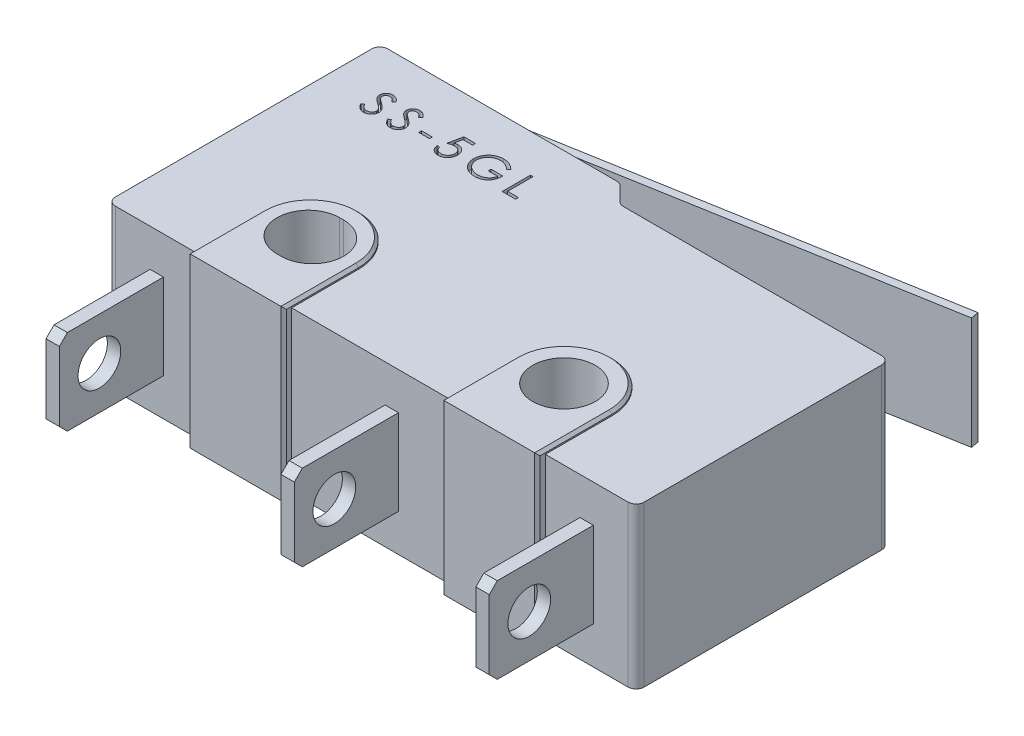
from build123d import *

# Parameters (mm, degrees)
BASE_EXTRUDE_DEPTH       = 6
SKETCH2_R                = 1.175
CUT_EXTRUDE1_DEPTH       = 24.066859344
BOSS_EXTRUDE1_START      = 0.15
SKETCH3_R                = 1.175
BOSS_EXTRUDE1_DEPTH      = 0.15
SKETCH4_R                = 1.175
BOSS_EXTRUDE2_DEPTH      = 0.15
CHAMFER1_SIZE            = 0.1
SKETCH5_W                = 2
SKETCH5_H                = 3.2
BOSS_EXTRUDE3_DEPTH      = 1.2
FILLET1_R                = 0.7
SKETCH6_W                = 0.5
SKETCH6_H                = 3.2
BOSS_EXTRUDE4_DEPTH      = 3.9
CHAMFER2_SIZE            = 0.3
SKETCH7_R                = 0.8
CUT_EXTRUDE2_DEPTH       = 23.338811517
BOSS_EXTRUDE5_DEPTH      = 0.3
CHAMFER3_SIZE            = 0.1
BOSS_EXTRUDE6_DEPTH      = 2.1
BOSS_EXTRUDE6_DEPTH_BACK = 2.1
SKETCH12_W               = 0.407051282
SKETCH12_H               = 0.108547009
CUT_EXTRUDE3_DEPTH       = 0.3


with BuildPart() as part:
    # Sketch1 → Base-Extrude (new body)
    with BuildSketch(Plane(origin=(0, 0, 0), x_dir=(1, 0, 0), z_dir=(0, 1, 0))):
        with BuildLine():
            Line((19.5, 9.5), (9.824264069, 9.5))
            ThreePointArc((9.824264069, 9.5), (9.709459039, 9.52283614), (9.612132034, 9.587867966))
            Line((9.612132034, 9.587867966), (9.087867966, 10.112132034))
            ThreePointArc((9.087867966, 10.112132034), (8.990540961, 10.17716386), (8.875735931, 10.2))
            Line((8.875735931, 10.2), (0.3, 10.2))
            ThreePointArc((0.3, 10.2), (0.087867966, 10.112132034), (0, 9.9))
            Line((0, 9.9), (0, 0.3))
            ThreePointArc((0, 0.3), (0.087867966, 0.087867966), (0.3, 0))
            Line((0.3, 0), (19.5, 0))
            ThreePointArc((19.5, 0), (19.712132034, 0.087867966), (19.8, 0.3))
            Line((19.8, 0.3), (19.8, 9.2))
            ThreePointArc((19.8, 9.2), (19.712132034, 9.412132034), (19.5, 9.5))
        make_face()
    extrude(amount=BASE_EXTRUDE_DEPTH)

    # Sketch2 → Cut-Extrude1 (cut, through all)
    with BuildSketch(Plane(origin=(0, 6, 0), x_dir=(-1, 0, 0), z_dir=(0, 1, 0))):
        with Locations(Location((-14.6, -2.5, 0), (0, 0, 90))):
            Circle(SKETCH2_R)
        with BuildLine():
            Line((-5.025, -3.675), (-5.175, -3.675))
            ThreePointArc((-5.175, -3.675), (-6.35, -2.5), (-5.175, -1.325))
            Line((-5.175, -1.325), (-5.025, -1.325))
            ThreePointArc((-5.025, -1.325), (-3.85, -2.5), (-5.025, -3.675))
        make_face()
    extrude(amount=-CUT_EXTRUDE1_DEPTH, mode=Mode.SUBTRACT)

    # Sketch3 → Boss-Extrude1 (add)
    # profile 1 of 2: a face of its own
    with BuildSketch(Plane(origin=(0, 6, 0), x_dir=(-1, 0, 0), z_dir=(0, 1, 0)).offset(BOSS_EXTRUDE1_START)):
        with BuildLine():
            Line((-3.3, 0), (-6.9, 0))
            Line((-6.9, 0), (-6.9, -2.5))
            ThreePointArc((-6.9, -2.5), (-5.1, -4.3), (-3.3, -2.5))
            Line((-3.3, -2.5), (-3.3, 0))
        make_face()
        with BuildLine():
            Line((-5.175, -3.675), (-5.025, -3.675))
            ThreePointArc((-5.025, -3.675), (-3.85, -2.5), (-5.025, -1.325))
            Line((-5.025, -1.325), (-5.175, -1.325))
            ThreePointArc((-5.175, -1.325), (-6.35, -2.5), (-5.175, -3.675))
        make_face(mode=Mode.SUBTRACT)
    # profile 2 of 2: a face of its own
    with BuildSketch(Plane(origin=(0, 6, 0), x_dir=(-1, 0, 0), z_dir=(0, 1, 0)).offset(BOSS_EXTRUDE1_START)):
        with BuildLine():
            Line((-12.8, -2.5), (-12.8, 0))
            Line((-12.8, 0), (-16.4, 0))
            Line((-16.4, 0), (-16.4, -2.5))
            ThreePointArc((-16.4, -2.5), (-14.6, -4.3), (-12.8, -2.5))
        make_face()
        with Locations(Location((-14.6, -2.5, 0), (0, 0, 90))):
            Circle(SKETCH3_R, mode=Mode.SUBTRACT)
    extrude(amount=-BOSS_EXTRUDE1_DEPTH)

    # Sketch4 → Boss-Extrude2 (add)
    # profile 1 of 2: a face of its own
    with BuildSketch(Plane.XZ):
        with BuildLine():
            Line((16.4, 0), (12.8, 0))
            Line((12.8, 0), (12.8, -2.5))
            ThreePointArc((12.8, -2.5), (14.6, -4.3), (16.4, -2.5))
            Line((16.4, -2.5), (16.4, 0))
        make_face()
        with Locations(Location((14.6, -2.5, 0), (0, 0, 90))):
            Circle(SKETCH4_R, mode=Mode.SUBTRACT)
    # profile 2 of 2: a face of its own
    with BuildSketch(Plane.XZ):
        with BuildLine():
            Line((3.3, 0), (3.3, -2.5))
            ThreePointArc((3.3, -2.5), (5.1, -4.3), (6.9, -2.5))
            Line((6.9, -2.5), (6.9, 0))
            Line((6.9, 0), (3.3, 0))
        make_face()
        with BuildLine():
            Line((5.025, -1.325), (5.175, -1.325))
            ThreePointArc((5.175, -1.325), (6.35, -2.5), (5.175, -3.675))
            Line((5.175, -3.675), (5.025, -3.675))
            ThreePointArc((5.025, -3.675), (3.85, -2.5), (5.025, -1.325))
        make_face(mode=Mode.SUBTRACT)
    extrude(amount=BOSS_EXTRUDE2_DEPTH)

    # Chamfer1
    chamfer1_edges = [part.edges().sort_by_distance(p)[0] for p in [
        (5.1, -0.15, -4.3),
        (6.9, -0.15, -1.25),
        (3.3, -0.15, -1.25),
        (3.3, 6.15, -1.25),
        (6.9, 6.15, -1.25),
        (5.1, 6.15, -4.3),
        (16.4, 6.15, -1.25),
        (14.6, 6.15, -4.3),
        (12.8, 6.15, -1.25),
        (12.8, -0.15, -1.25),
        (14.6, -0.15, -4.3),
        (16.4, -0.15, -1.25),
    ]]
    chamfer(chamfer1_edges, length=CHAMFER1_SIZE)

    # Sketch5 → Boss-Extrude3 (add)
    with BuildSketch(Plane(origin=(0, 0, -10.2), x_dir=(-1, 0, 0), z_dir=(0, 0, -1))):
        with Locations((-7.1, 3)):
            Rectangle(SKETCH5_W, SKETCH5_H)
    extrude(amount=BOSS_EXTRUDE3_DEPTH)

    # Fillet1
    fillet1_edges = [part.edges().sort_by_distance(p)[0] for p in [
        (8.1, 3, -11.4),
        (6.1, 3, -11.4),
    ]]
    fillet(fillet1_edges, radius=FILLET1_R)

    # Sketch6 → Boss-Extrude4 (add)
    with BuildSketch(Plane.XY):
        with Locations((1.85, 3)):
            Rectangle(SKETCH6_W, SKETCH6_H)
        with Locations((10.65, 3)):
            Rectangle(SKETCH6_W, SKETCH6_H)
        with Locations((17.95, 3)):
            Rectangle(SKETCH6_W, SKETCH6_H)
    extrude(amount=BOSS_EXTRUDE4_DEPTH)

    # Chamfer2
    chamfer2_edges = [part.edges().sort_by_distance(p)[0] for p in [
        (1.85, 1.4, 3.9),
        (1.85, 4.6, 3.9),
        (10.65, 1.4, 3.9),
        (10.65, 4.6, 3.9),
        (17.95, 1.4, 3.9),
        (17.95, 4.6, 3.9),
    ]]
    chamfer(chamfer2_edges, length=CHAMFER2_SIZE)

    # Sketch7 → Cut-Extrude2 (cut, through all)
    with BuildSketch(Plane.ZY.offset(-1.6)):
        with Locations((2.4, 3)):
            Circle(SKETCH7_R)
    extrude(amount=-CUT_EXTRUDE2_DEPTH, mode=Mode.SUBTRACT)

    # Sketch8 → Boss-Extrude5 (add)
    with BuildSketch(Plane.XY):
        Polygon((16.4, -0.05), (16.4, 6.05), (16.3, 6.15), (12.9, 6.15), (12.8, 6.05), (12.8, -0.05), (12.9, -0.15), (16.3, -0.15), align=None)
        Polygon((6.9, -0.05), (6.9, 6.05), (6.8, 6.15), (3.4, 6.15), (3.3, 6.05), (3.3, -0.05), (3.4, -0.15), (6.8, -0.15), align=None)
    extrude(amount=BOSS_EXTRUDE5_DEPTH)

    # Chamfer3
    chamfer3_edges = [part.edges().sort_by_distance(p)[0] for p in [
        (12.8, 3, 0.3),
        (16.4, 3, 0.3),
        (3.3, 3, 0.3),
        (6.9, 3, 0.3),
    ]]
    chamfer(chamfer3_edges, length=CHAMFER3_SIZE)

    # Sketch11 → Boss-Extrude6 (add, two sides: drawn at the far end of the back side and taken through both)
    with BuildSketch(Plane(origin=(0, 3, 0), x_dir=(-1, 0, 0), z_dir=(0, 1, 0)).offset(-BOSS_EXTRUDE6_DEPTH_BACK)):
        with BuildLine():
            Line((-19.005311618, -13.6), (-2.948383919, -10.795526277))
            ThreePointArc((-2.948383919, -10.795526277), (-2.770342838, -10.693022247), (-2.7, -10.5))
            Line((-2.7, -10.5), (-2.7, -10.2))
            Line((-2.7, -10.2), (-3, -10.2))
            Line((-3, -10.2), (-3, -10.5))
            Line((-3, -10.5), (-19.056927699, -13.304473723))
            Line((-19.056927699, -13.304473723), (-19.005311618, -13.6))
        make_face()
    extrude(amount=BOSS_EXTRUDE6_DEPTH + BOSS_EXTRUDE6_DEPTH_BACK)

    # Sketch12 → Cut-Extrude3 (cut)
    with BuildSketch(Plane(origin=(-12.497117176, 6, -3.291404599), x_dir=(1, 0, 0), z_dir=(0, 1, 0))):
        with BuildLine():
            Line((14.069489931, 4.629493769), (14.158956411, 4.683131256))
            add(Edge.make_bspline(
                [(14.158956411, 4.683131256), (14.167277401, 4.669202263), (14.183220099, 4.642514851), (14.209814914, 4.606453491), (14.237371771, 4.575803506), (14.266094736, 4.550743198), (14.295808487, 4.531013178), (14.326706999, 4.517042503), (14.358686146, 4.508329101), (14.380449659, 4.507270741), (14.391314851, 4.506742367)],
                knots=[0, 0, 0, 0, 1.272034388, 2.437168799, 3.508375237, 4.49857839, 5.41946034, 6.295179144, 7.148887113, 8, 8, 8, 8], degree=3))
            add(Edge.make_bspline(
                [(14.391314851, 4.506742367), (14.400593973, 4.507000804), (14.418989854, 4.507513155), (14.446071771, 4.512436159), (14.472373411, 4.519999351), (14.497352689, 4.530830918), (14.520664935, 4.543935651), (14.541107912, 4.559764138), (14.558780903, 4.577485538), (14.573237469, 4.597256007), (14.584328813, 4.618518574), (14.592853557, 4.640343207), (14.597584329, 4.66307275), (14.598296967, 4.67837639), (14.598656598, 4.686099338)],
                knots=[0, 0, 0, 0, 1.095163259, 2.171163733, 3.241058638, 4.321873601, 5.38011039, 6.391990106, 7.366004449, 8.327778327, 9.272591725, 10.192022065, 11.087607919, 12, 12, 12, 12], degree=3))
            add(Edge.make_bspline(
                [(14.598656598, 4.686099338), (14.598210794, 4.694910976), (14.597304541, 4.712823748), (14.589644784, 4.739251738), (14.577595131, 4.765405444), (14.566478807, 4.781583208), (14.560707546, 4.789982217)],
                knots=[0, 0, 0, 0, 0.938893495, 1.908633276, 2.914225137, 4, 4, 4, 4], degree=3))
            add(Edge.make_bspline(
                [(14.560707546, 4.789982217), (14.555969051, 4.796043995), (14.546021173, 4.808769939), (14.528919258, 4.827712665), (14.508851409, 4.847252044), (14.486504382, 4.868134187), (14.461064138, 4.889387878), (14.433327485, 4.912026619), (14.402586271, 4.935189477), (14.381026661, 4.950723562), (14.369902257, 4.958738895)],
                knots=[0, 0, 0, 0, 0.722233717, 1.516239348, 2.393582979, 3.351407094, 4.387010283, 5.505090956, 6.712668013, 8, 8, 8, 8], degree=3))
            add(Edge.make_bspline(
                [(14.369902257, 4.958738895), (14.358767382, 4.96666992), (14.337478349, 4.981833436), (14.307706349, 5.004337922), (14.281083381, 5.024913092), (14.257727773, 5.043752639), (14.2376498, 5.060859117), (14.220691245, 5.076068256), (14.20728411, 5.08979138), (14.199828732, 5.098693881), (14.196481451, 5.102690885)],
                knots=[0, 0, 0, 0, 1.452282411, 2.77665338, 3.964542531, 5.026858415, 5.96415736, 6.766646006, 7.446254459, 8, 8, 8, 8], degree=3))
            add(Edge.make_bspline(
                [(14.196481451, 5.102690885), (14.191802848, 5.108920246), (14.182601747, 5.12117112), (14.170456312, 5.140319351), (14.16013328, 5.159920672), (14.15204086, 5.180027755), (14.145226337, 5.200358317), (14.140642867, 5.221177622), (14.13777285, 5.242392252), (14.137478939, 5.256668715), (14.137331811, 5.26381535)],
                knots=[0, 0, 0, 0, 1.068054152, 2.10047183, 3.106115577, 4.101338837, 5.06977816, 6.043150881, 7.020423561, 8, 8, 8, 8], degree=3))
            add(Edge.make_bspline(
                [(14.137331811, 5.26381535), (14.137726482, 5.275012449), (14.138507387, 5.297167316), (14.145111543, 5.3295314), (14.155535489, 5.360430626), (14.170138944, 5.389559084), (14.188964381, 5.416158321), (14.210749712, 5.440534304), (14.236697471, 5.461026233), (14.26516743, 5.478930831), (14.296329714, 5.492944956), (14.328984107, 5.503516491), (14.363182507, 5.509506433), (14.386345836, 5.510366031), (14.398099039, 5.510802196)],
                knots=[0, 0, 0, 0, 1.005424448, 1.989358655, 2.955360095, 3.929531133, 4.905563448, 5.876582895, 6.856512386, 7.866279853, 8.892233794, 9.918561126, 10.94386622, 12, 12, 12, 12], degree=3))
            add(Edge.make_bspline(
                [(14.398099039, 5.510802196), (14.410570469, 5.510372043), (14.435372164, 5.509516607), (14.471854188, 5.502078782), (14.506978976, 5.489771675), (14.53523444, 5.475805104), (14.557348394, 5.461855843), (14.574213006, 5.449149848), (14.591302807, 5.434522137), (14.608755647, 5.417933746), (14.626275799, 5.399232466), (14.644123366, 5.378546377), (14.662340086, 5.356001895), (14.67405912, 5.339907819), (14.680066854, 5.331657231)],
                knots=[0, 0, 0, 0, 1.286793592, 2.559021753, 3.825965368, 5.121522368, 5.803751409, 6.523245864, 7.299691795, 8.125521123, 9.008227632, 9.944561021, 10.946284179, 12, 12, 12, 12], degree=3))
            Line((14.680066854, 5.331657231), (14.594204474, 5.266571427))
            add(Edge.make_bspline(
                [(14.594204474, 5.266571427), (14.589019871, 5.273250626), (14.579035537, 5.286113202), (14.563877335, 5.304126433), (14.549590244, 5.32058094), (14.53551429, 5.334873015), (14.522392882, 5.347785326), (14.509657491, 5.3588403), (14.497491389, 5.368146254), (14.482155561, 5.378077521), (14.462888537, 5.387921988), (14.438702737, 5.396252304), (14.413427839, 5.40125824), (14.396213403, 5.401920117), (14.387498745, 5.402255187)],
                knots=[0, 0, 0, 0, 1.181633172, 2.275549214, 3.290209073, 4.226197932, 5.078386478, 5.862611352, 6.581680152, 7.217281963, 8.414376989, 9.595101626, 10.782541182, 12, 12, 12, 12], degree=3))
            add(Edge.make_bspline(
                [(14.387498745, 5.402255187), (14.376565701, 5.401888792), (14.355482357, 5.401182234), (14.325549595, 5.393465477), (14.298609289, 5.381315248), (14.275461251, 5.364286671), (14.256188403, 5.344111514), (14.242246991, 5.32089505), (14.23385587, 5.295258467), (14.232831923, 5.277375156), (14.232310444, 5.268267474)],
                knots=[0, 0, 0, 0, 1.14458467, 2.207223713, 3.21896685, 4.227309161, 5.202851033, 6.127160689, 7.046193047, 8, 8, 8, 8], degree=3))
            add(Edge.make_bspline(
                [(14.232310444, 5.268267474), (14.232429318, 5.262597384), (14.23266726, 5.251247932), (14.23598583, 5.234480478), (14.240249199, 5.217755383), (14.247005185, 5.20114784), (14.256332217, 5.184367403), (14.268580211, 5.167125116), (14.284005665, 5.149269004), (14.295821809, 5.137655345), (14.302060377, 5.131523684)],
                knots=[0, 0, 0, 0, 0.858281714, 1.717966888, 2.583508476, 3.4729293, 4.427298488, 5.488583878, 6.674047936, 8, 8, 8, 8], degree=3))
            add(Edge.make_bspline(
                [(14.302060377, 5.131523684), (14.30437703, 5.129456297), (14.309880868, 5.12454466), (14.319942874, 5.116503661), (14.333230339, 5.106584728), (14.34939629, 5.094311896), (14.368738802, 5.080075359), (14.391260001, 5.064057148), (14.416708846, 5.045737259), (14.434767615, 5.032929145), (14.44431632, 5.026156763)],
                knots=[0, 0, 0, 0, 0.420754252, 0.999615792, 1.744751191, 2.668019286, 3.750313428, 4.999500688, 6.413464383, 8, 8, 8, 8], degree=3))
            add(Edge.make_bspline(
                [(14.44431632, 5.026156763), (14.455802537, 5.017798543), (14.478044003, 5.001614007), (14.509690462, 4.977297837), (14.538384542, 4.95351625), (14.564226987, 4.930421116), (14.5874731, 4.908187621), (14.607864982, 4.886548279), (14.625610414, 4.865658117), (14.644714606, 4.838875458), (14.664235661, 4.80598213), (14.681000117, 4.765681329), (14.691570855, 4.72522387), (14.692953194, 4.698031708), (14.69363523, 4.684615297)],
                knots=[0, 0, 0, 0, 1.163667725, 2.253281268, 3.268753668, 4.215851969, 5.092017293, 5.902905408, 6.650798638, 7.335211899, 8.59617414, 9.77448103, 10.901945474, 12, 12, 12, 12], degree=3))
            add(Edge.make_bspline(
                [(14.69363523, 4.684615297), (14.693436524, 4.675127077), (14.693042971, 4.656334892), (14.688519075, 4.628741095), (14.681890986, 4.601940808), (14.671901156, 4.576265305), (14.659708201, 4.551244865), (14.644236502, 4.527535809), (14.626302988, 4.504613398), (14.605730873, 4.483088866), (14.58321985, 4.463329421), (14.5594274, 4.4457523), (14.534314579, 4.431096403), (14.508017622, 4.419136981), (14.480530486, 4.409783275), (14.451862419, 4.40300605), (14.421966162, 4.398846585), (14.401646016, 4.398414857), (14.391314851, 4.398195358)],
                knots=[0, 0, 0, 0, 0.983748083, 1.948392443, 2.894712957, 3.844097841, 4.80183111, 5.778335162, 6.776009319, 7.81870978, 8.863265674, 9.881300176, 10.883814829, 11.87499822, 12.874611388, 13.892143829, 14.928324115, 16, 16, 16, 16], degree=3))
            add(Edge.make_bspline(
                [(14.391314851, 4.398195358), (14.383321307, 4.39834993), (14.367434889, 4.398657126), (14.343937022, 4.401372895), (14.32091386, 4.405215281), (14.298654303, 4.411315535), (14.276871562, 4.418716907), (14.255660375, 4.427830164), (14.235010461, 4.438751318), (14.214806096, 4.451238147), (14.195098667, 4.465769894), (14.176073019, 4.482695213), (14.157104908, 4.501547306), (14.138754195, 4.522838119), (14.120649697, 4.546223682), (14.103148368, 4.571922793), (14.085887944, 4.599795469), (14.075058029, 4.619409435), (14.069489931, 4.629493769)],
                knots=[0, 0, 0, 0, 0.915332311, 1.819136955, 2.706846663, 3.586547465, 4.459518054, 5.340707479, 6.227863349, 7.133153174, 8.059268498, 9.028702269, 10.047606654, 11.120612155, 12.245963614, 13.433783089, 14.680604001, 16, 16, 16, 16], degree=3))
        make_face()
        with BuildLine():
            Line((15.070836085, 4.629493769), (15.160302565, 4.683131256))
            add(Edge.make_bspline(
                [(15.160302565, 4.683131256), (15.168623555, 4.669202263), (15.184566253, 4.642514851), (15.211161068, 4.606453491), (15.238717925, 4.575803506), (15.26744089, 4.550743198), (15.297154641, 4.531013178), (15.328053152, 4.517042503), (15.3600323, 4.508329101), (15.381795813, 4.507270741), (15.392661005, 4.506742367)],
                knots=[0, 0, 0, 0, 1.272034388, 2.437168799, 3.508375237, 4.49857839, 5.41946034, 6.295179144, 7.148887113, 8, 8, 8, 8], degree=3))
            add(Edge.make_bspline(
                [(15.392661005, 4.506742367), (15.401940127, 4.507000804), (15.420336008, 4.507513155), (15.447417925, 4.512436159), (15.473719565, 4.519999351), (15.498698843, 4.530830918), (15.522011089, 4.543935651), (15.542454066, 4.559764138), (15.560127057, 4.577485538), (15.574583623, 4.597256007), (15.585674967, 4.618518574), (15.594199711, 4.640343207), (15.598930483, 4.66307275), (15.599643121, 4.67837639), (15.600002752, 4.686099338)],
                knots=[0, 0, 0, 0, 1.095163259, 2.171163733, 3.241058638, 4.321873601, 5.38011039, 6.391990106, 7.366004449, 8.327778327, 9.272591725, 10.192022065, 11.087607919, 12, 12, 12, 12], degree=3))
            add(Edge.make_bspline(
                [(15.600002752, 4.686099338), (15.599556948, 4.694910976), (15.598650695, 4.712823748), (15.590990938, 4.739251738), (15.578941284, 4.765405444), (15.567824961, 4.781583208), (15.5620537, 4.789982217)],
                knots=[0, 0, 0, 0, 0.938893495, 1.908633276, 2.914225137, 4, 4, 4, 4], degree=3))
            add(Edge.make_bspline(
                [(15.5620537, 4.789982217), (15.557315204, 4.796043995), (15.547367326, 4.808769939), (15.530265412, 4.827712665), (15.510197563, 4.847252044), (15.487850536, 4.868134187), (15.462410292, 4.889387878), (15.434673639, 4.912026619), (15.403932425, 4.935189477), (15.382372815, 4.950723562), (15.371248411, 4.958738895)],
                knots=[0, 0, 0, 0, 0.722233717, 1.516239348, 2.393582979, 3.351407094, 4.387010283, 5.505090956, 6.712668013, 8, 8, 8, 8], degree=3))
            add(Edge.make_bspline(
                [(15.371248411, 4.958738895), (15.360113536, 4.96666992), (15.338824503, 4.981833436), (15.309052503, 5.004337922), (15.282429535, 5.024913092), (15.259073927, 5.043752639), (15.238995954, 5.060859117), (15.222037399, 5.076068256), (15.208630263, 5.08979138), (15.201174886, 5.098693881), (15.197827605, 5.102690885)],
                knots=[0, 0, 0, 0, 1.452282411, 2.77665338, 3.964542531, 5.026858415, 5.96415736, 6.766646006, 7.446254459, 8, 8, 8, 8], degree=3))
            add(Edge.make_bspline(
                [(15.197827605, 5.102690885), (15.193149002, 5.108920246), (15.183947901, 5.12117112), (15.171802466, 5.140319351), (15.161479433, 5.159920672), (15.153387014, 5.180027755), (15.146572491, 5.200358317), (15.141989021, 5.221177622), (15.139119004, 5.242392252), (15.138825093, 5.256668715), (15.138677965, 5.26381535)],
                knots=[0, 0, 0, 0, 1.068054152, 2.10047183, 3.106115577, 4.101338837, 5.06977816, 6.043150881, 7.020423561, 8, 8, 8, 8], degree=3))
            add(Edge.make_bspline(
                [(15.138677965, 5.26381535), (15.139072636, 5.275012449), (15.13985354, 5.297167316), (15.146457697, 5.3295314), (15.156881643, 5.360430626), (15.171485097, 5.389559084), (15.190310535, 5.416158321), (15.212095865, 5.440534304), (15.238043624, 5.461026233), (15.266513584, 5.478930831), (15.297675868, 5.492944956), (15.33033026, 5.503516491), (15.364528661, 5.509506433), (15.38769199, 5.510366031), (15.399445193, 5.510802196)],
                knots=[0, 0, 0, 0, 1.005424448, 1.989358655, 2.955360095, 3.929531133, 4.905563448, 5.876582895, 6.856512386, 7.866279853, 8.892233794, 9.918561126, 10.94386622, 12, 12, 12, 12], degree=3))
            add(Edge.make_bspline(
                [(15.399445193, 5.510802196), (15.411916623, 5.510372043), (15.436718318, 5.509516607), (15.473200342, 5.502078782), (15.50832513, 5.489771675), (15.536580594, 5.475805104), (15.558694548, 5.461855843), (15.57555916, 5.449149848), (15.59264896, 5.434522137), (15.610101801, 5.417933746), (15.627621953, 5.399232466), (15.64546952, 5.378546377), (15.66368624, 5.356001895), (15.675405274, 5.339907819), (15.681413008, 5.331657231)],
                knots=[0, 0, 0, 0, 1.286793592, 2.559021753, 3.825965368, 5.121522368, 5.803751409, 6.523245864, 7.299691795, 8.125521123, 9.008227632, 9.944561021, 10.946284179, 12, 12, 12, 12], degree=3))
            Line((15.681413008, 5.331657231), (15.595550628, 5.266571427))
            add(Edge.make_bspline(
                [(15.595550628, 5.266571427), (15.590366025, 5.273250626), (15.580381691, 5.286113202), (15.565223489, 5.304126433), (15.550936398, 5.32058094), (15.536860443, 5.334873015), (15.523739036, 5.347785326), (15.511003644, 5.3588403), (15.498837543, 5.368146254), (15.483501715, 5.378077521), (15.464234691, 5.387921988), (15.440048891, 5.396252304), (15.414773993, 5.40125824), (15.397559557, 5.401920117), (15.388844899, 5.402255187)],
                knots=[0, 0, 0, 0, 1.181633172, 2.275549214, 3.290209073, 4.226197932, 5.078386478, 5.862611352, 6.581680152, 7.217281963, 8.414376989, 9.595101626, 10.782541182, 12, 12, 12, 12], degree=3))
            add(Edge.make_bspline(
                [(15.388844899, 5.402255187), (15.377911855, 5.401888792), (15.35682851, 5.401182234), (15.326895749, 5.393465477), (15.299955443, 5.381315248), (15.276807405, 5.364286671), (15.257534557, 5.344111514), (15.243593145, 5.32089505), (15.235202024, 5.295258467), (15.234178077, 5.277375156), (15.233656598, 5.268267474)],
                knots=[0, 0, 0, 0, 1.14458467, 2.207223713, 3.21896685, 4.227309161, 5.202851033, 6.127160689, 7.046193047, 8, 8, 8, 8], degree=3))
            add(Edge.make_bspline(
                [(15.233656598, 5.268267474), (15.233775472, 5.262597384), (15.234013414, 5.251247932), (15.237331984, 5.234480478), (15.241595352, 5.217755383), (15.248351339, 5.20114784), (15.257678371, 5.184367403), (15.269926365, 5.167125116), (15.285351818, 5.149269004), (15.297167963, 5.137655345), (15.303406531, 5.131523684)],
                knots=[0, 0, 0, 0, 0.858281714, 1.717966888, 2.583508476, 3.4729293, 4.427298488, 5.488583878, 6.674047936, 8, 8, 8, 8], degree=3))
            add(Edge.make_bspline(
                [(15.303406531, 5.131523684), (15.305723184, 5.129456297), (15.311227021, 5.12454466), (15.321289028, 5.116503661), (15.334576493, 5.106584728), (15.350742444, 5.094311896), (15.370084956, 5.080075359), (15.392606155, 5.064057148), (15.418054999, 5.045737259), (15.436113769, 5.032929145), (15.445662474, 5.026156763)],
                knots=[0, 0, 0, 0, 0.420754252, 0.999615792, 1.744751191, 2.668019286, 3.750313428, 4.999500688, 6.413464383, 8, 8, 8, 8], degree=3))
            add(Edge.make_bspline(
                [(15.445662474, 5.026156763), (15.45714869, 5.017798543), (15.479390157, 5.001614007), (15.511036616, 4.977297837), (15.539730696, 4.95351625), (15.565573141, 4.930421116), (15.588819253, 4.908187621), (15.609211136, 4.886548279), (15.626956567, 4.865658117), (15.64606076, 4.838875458), (15.665581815, 4.80598213), (15.682346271, 4.765681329), (15.692917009, 4.72522387), (15.694299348, 4.698031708), (15.694981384, 4.684615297)],
                knots=[0, 0, 0, 0, 1.163667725, 2.253281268, 3.268753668, 4.215851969, 5.092017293, 5.902905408, 6.650798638, 7.335211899, 8.59617414, 9.77448103, 10.901945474, 12, 12, 12, 12], degree=3))
            add(Edge.make_bspline(
                [(15.694981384, 4.684615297), (15.694782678, 4.675127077), (15.694389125, 4.656334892), (15.689865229, 4.628741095), (15.68323714, 4.601940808), (15.67324731, 4.576265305), (15.661054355, 4.551244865), (15.645582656, 4.527535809), (15.627649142, 4.504613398), (15.607077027, 4.483088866), (15.584566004, 4.463329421), (15.560773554, 4.4457523), (15.535660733, 4.431096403), (15.509363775, 4.419136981), (15.48187664, 4.409783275), (15.453208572, 4.40300605), (15.423312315, 4.398846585), (15.40299217, 4.398414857), (15.392661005, 4.398195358)],
                knots=[0, 0, 0, 0, 0.983748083, 1.948392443, 2.894712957, 3.844097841, 4.80183111, 5.778335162, 6.776009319, 7.81870978, 8.863265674, 9.881300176, 10.883814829, 11.87499822, 12.874611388, 13.892143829, 14.928324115, 16, 16, 16, 16], degree=3))
            add(Edge.make_bspline(
                [(15.392661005, 4.398195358), (15.384667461, 4.39834993), (15.368781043, 4.398657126), (15.345283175, 4.401372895), (15.322260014, 4.405215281), (15.300000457, 4.411315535), (15.278217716, 4.418716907), (15.257006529, 4.427830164), (15.236356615, 4.438751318), (15.21615225, 4.451238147), (15.196444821, 4.465769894), (15.177419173, 4.482695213), (15.158451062, 4.501547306), (15.140100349, 4.522838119), (15.121995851, 4.546223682), (15.104494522, 4.571922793), (15.087234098, 4.599795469), (15.076404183, 4.619409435), (15.070836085, 4.629493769)],
                knots=[0, 0, 0, 0, 0.915332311, 1.819136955, 2.706846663, 3.586547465, 4.459518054, 5.340707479, 6.227863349, 7.133153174, 8.059268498, 9.028702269, 10.047606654, 11.120612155, 12.245963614, 13.433783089, 14.680604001, 16, 16, 16, 16], degree=3))
        make_face()
        with Locations((16.289276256, 4.832383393)):
            Rectangle(SKETCH12_W, SKETCH12_H)
        with BuildLine():
            Line((17.507716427, 5.483665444), (17.507716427, 5.375118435))
            Line((17.507716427, 5.375118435), (17.147730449, 5.375118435))
            Line((17.147730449, 5.375118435), (17.090700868, 5.09675472))
            add(Edge.make_bspline(
                [(17.090700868, 5.09675472), (17.101905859, 5.099848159), (17.123613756, 5.105841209), (17.155654, 5.112495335), (17.186071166, 5.116506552), (17.205809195, 5.117054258), (17.215360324, 5.11731929)],
                knots=[0, 0, 0, 0, 1.100273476, 2.13160584, 3.095893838, 4, 4, 4, 4], degree=3))
            add(Edge.make_bspline(
                [(17.215360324, 5.11731929), (17.227178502, 5.117063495), (17.250415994, 5.116560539), (17.28441539, 5.111730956), (17.316870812, 5.104129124), (17.347714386, 5.093509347), (17.377003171, 5.079929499), (17.404467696, 5.062965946), (17.430520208, 5.043149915), (17.454693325, 5.020367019), (17.476623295, 4.995293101), (17.495904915, 4.968333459), (17.512282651, 4.939750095), (17.525454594, 4.909269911), (17.535972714, 4.877229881), (17.542973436, 4.843292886), (17.547635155, 4.807778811), (17.548155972, 4.783496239), (17.548421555, 4.771113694)],
                knots=[0, 0, 0, 0, 1.052922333, 2.070308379, 3.05430497, 4.020497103, 4.973039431, 5.925935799, 6.892292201, 7.88610001, 8.88166317, 9.857072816, 10.836096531, 11.812156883, 12.81219415, 13.836441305, 14.89672472, 16, 16, 16, 16], degree=3))
            add(Edge.make_bspline(
                [(17.548421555, 4.771113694), (17.548220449, 4.762489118), (17.547820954, 4.74535652), (17.545789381, 4.719912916), (17.541877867, 4.695007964), (17.536626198, 4.67063836), (17.529809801, 4.64685024), (17.52155811, 4.623575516), (17.511459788, 4.600959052), (17.500383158, 4.578786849), (17.487911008, 4.557560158), (17.47406846, 4.537709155), (17.459443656, 4.51893605), (17.443707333, 4.501442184), (17.426713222, 4.485342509), (17.408667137, 4.470541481), (17.389713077, 4.456788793), (17.369557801, 4.444642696), (17.348650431, 4.433465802), (17.326689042, 4.424296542), (17.304173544, 4.416098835), (17.28077988, 4.409564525), (17.256561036, 4.404444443), (17.231477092, 4.400966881), (17.205659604, 4.398434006), (17.188159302, 4.39827545), (17.179319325, 4.398195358)],
                knots=[0, 0, 0, 0, 1.056347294, 2.098418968, 3.122841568, 4.141288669, 5.149314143, 6.15115421, 7.162517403, 8.180376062, 9.185164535, 10.17417709, 11.141909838, 12.097768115, 13.052685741, 14.0056014, 14.954263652, 15.917497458, 16.885230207, 17.854509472, 18.828990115, 19.81800267, 20.826176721, 21.857883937, 22.917946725, 24, 24, 24, 24], degree=3))
            add(Edge.make_bspline(
                [(17.179319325, 4.398195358), (17.168774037, 4.398404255), (17.148027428, 4.398815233), (17.117631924, 4.403114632), (17.088387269, 4.409272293), (17.060528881, 4.418536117), (17.033807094, 4.430143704), (17.008581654, 4.44481407), (16.984208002, 4.461438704), (16.961676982, 4.481057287), (16.94076549, 4.502500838), (16.922046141, 4.525771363), (16.905374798, 4.55048479), (16.891018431, 4.576761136), (16.878772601, 4.604531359), (16.869152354, 4.633899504), (16.861387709, 4.664712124), (16.858102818, 4.68592521), (16.856434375, 4.696699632)],
                knots=[0, 0, 0, 0, 1.0467383, 2.05933395, 3.04377827, 4.011590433, 4.970194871, 5.932262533, 6.905835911, 7.896367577, 8.894135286, 9.877477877, 10.858688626, 11.851381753, 12.8477658, 13.868841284, 14.917554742, 16, 16, 16, 16], degree=3))
            Line((16.856434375, 4.696699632), (16.951413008, 4.696699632))
            add(Edge.make_bspline(
                [(16.951413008, 4.696699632), (16.953749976, 4.686607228), (16.95824176, 4.667209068), (16.968101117, 4.639955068), (16.980155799, 4.615668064), (16.994489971, 4.594026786), (17.011589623, 4.575155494), (17.031102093, 4.558337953), (17.052978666, 4.54316595), (17.077288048, 4.530519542), (17.102933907, 4.51973399), (17.129775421, 4.51255193), (17.157081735, 4.507501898), (17.175550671, 4.50699639), (17.184831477, 4.506742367)],
                knots=[0, 0, 0, 0, 1.136247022, 2.183929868, 3.172523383, 4.106158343, 5.02341133, 5.958108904, 6.928429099, 7.938127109, 8.96079061, 9.975095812, 10.982467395, 12, 12, 12, 12], degree=3))
            add(Edge.make_bspline(
                [(17.184831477, 4.506742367), (17.19389034, 4.506990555), (17.211727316, 4.507479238), (17.237977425, 4.511240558), (17.263320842, 4.517033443), (17.287507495, 4.525702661), (17.310960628, 4.53623904), (17.333086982, 4.549760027), (17.354526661, 4.565320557), (17.374613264, 4.583147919), (17.393009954, 4.602793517), (17.409264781, 4.623802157), (17.422804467, 4.64621368), (17.434214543, 4.669640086), (17.442878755, 4.694338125), (17.449059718, 4.720192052), (17.452689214, 4.747265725), (17.4531885, 4.765731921), (17.453442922, 4.775141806)],
                knots=[0, 0, 0, 0, 1.027316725, 2.022795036, 3.002884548, 3.971462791, 4.93288096, 5.914575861, 6.907176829, 7.935150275, 8.956128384, 9.956726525, 10.942570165, 11.921478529, 12.907843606, 13.90538589, 14.932640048, 16, 16, 16, 16], degree=3))
            add(Edge.make_bspline(
                [(17.453442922, 4.775141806), (17.453243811, 4.783631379), (17.452854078, 4.800248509), (17.449669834, 4.824559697), (17.444131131, 4.847562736), (17.436443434, 4.869368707), (17.426682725, 4.889998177), (17.414754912, 4.909472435), (17.400436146, 4.927534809), (17.384079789, 4.944193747), (17.366161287, 4.959568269), (17.346372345, 4.972674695), (17.325127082, 4.983700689), (17.302681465, 4.993216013), (17.278501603, 5.000050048), (17.253066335, 5.005180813), (17.226100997, 5.008148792), (17.207664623, 5.008560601), (17.198187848, 5.008772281)],
                knots=[0, 0, 0, 0, 1.045622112, 2.046656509, 3.013763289, 3.955457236, 4.890082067, 5.820317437, 6.762574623, 7.722996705, 8.69280354, 9.665887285, 10.63943826, 11.638615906, 12.663482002, 13.728887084, 14.832589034, 16, 16, 16, 16], degree=3))
            add(Edge.make_bspline(
                [(17.198187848, 5.008772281), (17.189984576, 5.008596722), (17.173046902, 5.008234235), (17.147065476, 5.005565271), (17.119762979, 5.00125958), (17.091244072, 4.995337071), (17.061423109, 4.987586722), (17.030363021, 4.978299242), (16.997998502, 4.967195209), (16.976191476, 4.958809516), (16.964981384, 4.954498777)],
                knots=[0, 0, 0, 0, 0.817624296, 1.688186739, 2.600797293, 3.572016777, 4.590301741, 5.671205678, 6.80286297, 8, 8, 8, 8], degree=3))
            Line((16.964981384, 4.954498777), (17.073528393, 5.483665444))
            Line((17.073528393, 5.483665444), (17.507716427, 5.483665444))
        make_face()
        with BuildLine():
            Line((19.011092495, 5.303036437), (18.929682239, 5.225866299))
            add(Edge.make_bspline(
                [(18.929682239, 5.225866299), (18.914950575, 5.239724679), (18.885838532, 5.267110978), (18.838376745, 5.302644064), (18.788857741, 5.333083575), (18.737539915, 5.357850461), (18.685694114, 5.377611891), (18.634008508, 5.391681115), (18.58301326, 5.400653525), (18.549096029, 5.401726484), (18.532383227, 5.402255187)],
                knots=[0, 0, 0, 0, 1.08915593, 2.152340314, 3.188132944, 4.216796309, 5.218260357, 6.173443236, 7.099959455, 8, 8, 8, 8], degree=3))
            add(Edge.make_bspline(
                [(18.532383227, 5.402255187), (18.522128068, 5.402130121), (18.501644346, 5.401880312), (18.471218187, 5.398691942), (18.441111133, 5.394106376), (18.411380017, 5.38747157), (18.381967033, 5.37906264), (18.352974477, 5.368544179), (18.324348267, 5.356281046), (18.296358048, 5.342110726), (18.269222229, 5.326544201), (18.243593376, 5.309293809), (18.219308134, 5.290912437), (18.196822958, 5.270939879), (18.176008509, 5.249557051), (18.156369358, 5.227161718), (18.138596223, 5.20314202), (18.122542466, 5.177939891), (18.108221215, 5.151997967), (18.095579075, 5.125565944), (18.084966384, 5.098731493), (18.076569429, 5.07146094), (18.069641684, 5.043965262), (18.064768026, 5.016054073), (18.062020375, 4.987697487), (18.061545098, 4.968708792), (18.06130617, 4.959162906)],
                knots=[0, 0, 0, 0, 1.02818874, 2.053710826, 3.065248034, 4.081641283, 5.106893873, 6.131558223, 7.173050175, 8.228653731, 9.27666206, 10.308777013, 11.325269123, 12.329503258, 13.32196095, 14.316845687, 15.314881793, 16.315733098, 17.311955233, 18.285320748, 19.252783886, 20.203351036, 21.145449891, 22.095197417, 23.042428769, 24, 24, 24, 24], degree=3))
            add(Edge.make_bspline(
                [(18.06130617, 4.959162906), (18.061534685, 4.949404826), (18.061991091, 4.929915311), (18.064912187, 4.900828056), (18.070333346, 4.872172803), (18.077580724, 4.843855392), (18.086646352, 4.815827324), (18.097947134, 4.788210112), (18.111332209, 4.76100478), (18.126825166, 4.734456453), (18.143814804, 4.70859592), (18.162847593, 4.684236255), (18.18306496, 4.661053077), (18.205203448, 4.63956112), (18.228553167, 4.619185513), (18.253811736, 4.600487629), (18.28048248, 4.583107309), (18.30860609, 4.5672636), (18.337877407, 4.55310959), (18.367890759, 4.540523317), (18.398742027, 4.530157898), (18.430269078, 4.521709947), (18.462434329, 4.514785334), (18.495401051, 4.510330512), (18.528926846, 4.507097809), (18.551526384, 4.506861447), (18.562912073, 4.506742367)],
                knots=[0, 0, 0, 0, 0.93586088, 1.869166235, 2.799637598, 3.729985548, 4.670839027, 5.622275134, 6.589130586, 7.576015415, 8.568469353, 9.55398029, 10.53834874, 11.515998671, 12.510579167, 13.508179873, 14.527009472, 15.561807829, 16.601455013, 17.643573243, 18.680854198, 19.719860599, 20.772568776, 21.833555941, 22.908541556, 24, 24, 24, 24], degree=3))
            add(Edge.make_bspline(
                [(18.562912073, 4.506742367), (18.576633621, 4.507029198), (18.603578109, 4.507592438), (18.643185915, 4.51197705), (18.681226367, 4.518825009), (18.717592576, 4.528853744), (18.75232678, 4.54164557), (18.785556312, 4.557065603), (18.817019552, 4.57570529), (18.846811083, 4.596743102), (18.874254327, 4.620182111), (18.899005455, 4.645474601), (18.920669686, 4.672497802), (18.939569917, 4.701092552), (18.955205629, 4.731495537), (18.968039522, 4.763557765), (18.97787697, 4.797293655), (18.98191526, 4.820604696), (18.983955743, 4.832383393)],
                knots=[0, 0, 0, 0, 1.13008108, 2.219097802, 3.278683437, 4.311054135, 5.322181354, 6.324827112, 7.324222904, 8.330512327, 9.32562643, 10.293043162, 11.24128371, 12.174520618, 13.111833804, 14.052305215, 15.015860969, 16, 16, 16, 16], degree=3))
            Line((18.983955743, 4.832383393), (18.631177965, 4.832383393))
            Line((18.631177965, 4.832383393), (18.631177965, 4.940930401))
            Line((18.631177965, 4.940930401), (19.078934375, 4.940930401))
            add(Edge.make_bspline(
                [(19.078934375, 4.940930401), (19.078418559, 4.920698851), (19.077409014, 4.881102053), (19.07032758, 4.82335628), (19.058892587, 4.768815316), (19.043271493, 4.71742172), (19.023049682, 4.669248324), (18.998444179, 4.624246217), (18.969061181, 4.582706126), (18.935947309, 4.544288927), (18.898784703, 4.510020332), (18.858577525, 4.479901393), (18.815259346, 4.454530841), (18.768871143, 4.433890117), (18.719564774, 4.417781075), (18.667226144, 4.40635967), (18.611926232, 4.3995168), (18.574026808, 4.398642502), (18.554643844, 4.398195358)],
                knots=[0, 0, 0, 0, 1.140356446, 2.231883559, 3.274166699, 4.278491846, 5.25512956, 6.21435461, 7.1637429, 8.11826594, 9.068280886, 10.0076534, 10.945064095, 11.891975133, 12.864533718, 13.863980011, 14.907571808, 16, 16, 16, 16], degree=3))
            add(Edge.make_bspline(
                [(18.554643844, 4.398195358), (18.542696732, 4.39836745), (18.519133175, 4.39870687), (18.484331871, 4.401119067), (18.450490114, 4.40483248), (18.417612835, 4.410440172), (18.385579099, 4.417308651), (18.354548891, 4.42610392), (18.324404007, 4.436284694), (18.295097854, 4.447864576), (18.266896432, 4.46128172), (18.239674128, 4.476192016), (18.213280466, 4.492518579), (18.187895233, 4.510543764), (18.163386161, 4.530132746), (18.139911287, 4.551324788), (18.11733919, 4.574055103), (18.103199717, 4.590195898), (18.096075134, 4.598328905)],
                knots=[0, 0, 0, 0, 1.107784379, 2.184907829, 3.233506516, 4.263428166, 5.276301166, 6.270063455, 7.25232949, 8.225834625, 9.190232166, 10.146266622, 11.1027726, 12.066435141, 13.031522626, 14.010570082, 14.99756817, 16, 16, 16, 16], degree=3))
            add(Edge.make_bspline(
                [(18.096075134, 4.598328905), (18.085737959, 4.611231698), (18.065235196, 4.63682311), (18.038843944, 4.677825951), (18.016346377, 4.720280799), (17.998092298, 4.764305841), (17.983838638, 4.809859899), (17.973616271, 4.85688476), (17.967626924, 4.905440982), (17.966764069, 4.938299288), (17.966327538, 4.954922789)],
                knots=[0, 0, 0, 0, 1.023165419, 2.029347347, 3.013907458, 3.994755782, 4.975994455, 5.96558838, 6.970761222, 8, 8, 8, 8], degree=3))
            add(Edge.make_bspline(
                [(17.966327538, 4.954922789), (17.966488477, 4.96737068), (17.966808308, 4.992108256), (17.9706865, 5.028834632), (17.976250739, 5.064908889), (17.984429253, 5.100301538), (17.994739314, 5.135036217), (18.007606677, 5.169129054), (18.02258811, 5.202600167), (18.040000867, 5.23521917), (18.059378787, 5.266553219), (18.080409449, 5.296476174), (18.10339149, 5.324443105), (18.127949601, 5.350808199), (18.154376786, 5.375240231), (18.182425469, 5.397965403), (18.212117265, 5.419014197), (18.243545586, 5.438055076), (18.276241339, 5.455158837), (18.310126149, 5.47015367), (18.345189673, 5.482546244), (18.381169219, 5.493061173), (18.41833713, 5.500836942), (18.456423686, 5.506475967), (18.49562741, 5.510334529), (18.522126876, 5.510644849), (18.535563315, 5.510802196)],
                knots=[0, 0, 0, 0, 1.008945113, 2.00506715, 2.99143336, 3.967273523, 4.948097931, 5.927297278, 6.919902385, 7.919676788, 8.923139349, 9.905703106, 10.883022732, 11.856032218, 12.825136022, 13.798837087, 14.781400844, 15.773989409, 16.776158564, 17.77167057, 18.775803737, 19.789618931, 20.80898985, 21.851988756, 22.910860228, 24, 24, 24, 24], degree=3))
            add(Edge.make_bspline(
                [(18.535563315, 5.510802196), (18.54652107, 5.510626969), (18.568249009, 5.510279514), (18.600581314, 5.507871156), (18.632413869, 5.504053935), (18.663793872, 5.498844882), (18.694614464, 5.491749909), (18.724963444, 5.483259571), (18.754884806, 5.473374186), (18.784284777, 5.461584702), (18.813361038, 5.448203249), (18.842275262, 5.433140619), (18.870928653, 5.416139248), (18.899370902, 5.397148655), (18.927781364, 5.376495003), (18.955710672, 5.353587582), (18.983832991, 5.329329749), (19.001915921, 5.311887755), (19.011092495, 5.303036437)],
                knots=[0, 0, 0, 0, 0.985871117, 1.954866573, 2.915460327, 3.869826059, 4.81536089, 5.759505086, 6.70452669, 7.649098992, 8.607881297, 9.583363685, 10.581137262, 11.603961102, 12.659522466, 13.73993555, 14.853081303, 16, 16, 16, 16], degree=3))
        make_face()
        Polygon((19.564682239, 5.483665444), (19.659660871, 5.483665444), (19.659660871, 4.533879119), (20.066712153, 4.533879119), (20.066712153, 4.42533211), (19.564682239, 4.42533211), align=None)
    extrude(amount=-CUT_EXTRUDE3_DEPTH, mode=Mode.SUBTRACT)


solid = part.part
